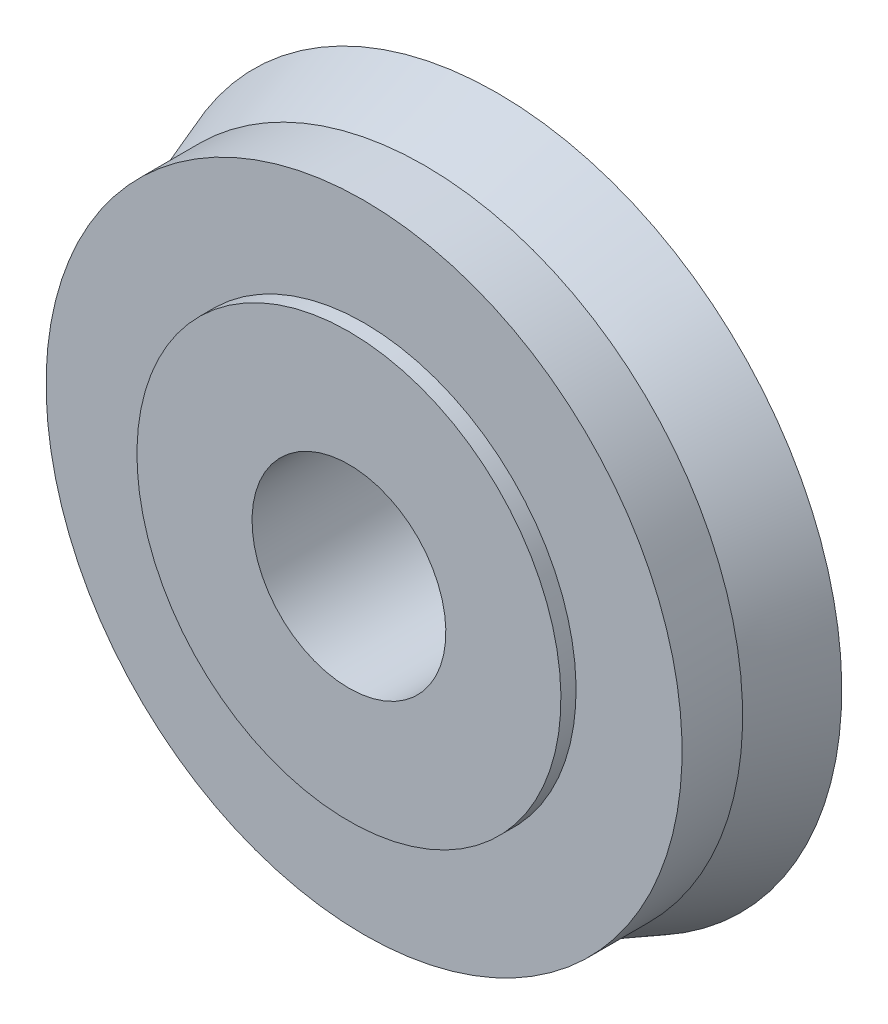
ISO-10303-21;
HEADER;
FILE_DESCRIPTION(('STEP AP214'),'2;1');
FILE_NAME('part.step','',(''),(''),'','','');
FILE_SCHEMA(('AUTOMOTIVE_DESIGN { 1 0 10303 214 1 1 1 1 }'));
ENDSEC;
DATA;
#1=APPLICATION_CONTEXT('core data for automotive mechanical design processes');
#2=APPLICATION_PROTOCOL_DEFINITION('international standard','automotive_design',2000,#1);
#3=PRODUCT_CONTEXT('',#1,'mechanical');
#4=PRODUCT('Part','Part','',(#3));
#5=PRODUCT_RELATED_PRODUCT_CATEGORY('part','',(#4));
#6=PRODUCT_DEFINITION_FORMATION('','',#4);
#7=PRODUCT_DEFINITION_CONTEXT('part definition',#1,'design');
#8=PRODUCT_DEFINITION('design','',#6,#7);
#9=PRODUCT_DEFINITION_SHAPE('','',#8);
#10=(LENGTH_UNIT() NAMED_UNIT(*) SI_UNIT(.MILLI.,.METRE.));
#11=(NAMED_UNIT(*) PLANE_ANGLE_UNIT() SI_UNIT($,.RADIAN.));
#12=(NAMED_UNIT(*) SI_UNIT($,.STERADIAN.) SOLID_ANGLE_UNIT());
#13=UNCERTAINTY_MEASURE_WITH_UNIT(LENGTH_MEASURE(1.E-05),#10,'distance_accuracy_value','');
#14=(GEOMETRIC_REPRESENTATION_CONTEXT(3) GLOBAL_UNCERTAINTY_ASSIGNED_CONTEXT((#13)) GLOBAL_UNIT_ASSIGNED_CONTEXT((#10,
#11,#12)) REPRESENTATION_CONTEXT('',''));
#15=CARTESIAN_POINT('',(0.,0.,0.));
#16=DIRECTION('',(0.,0.,1.));
#17=DIRECTION('',(1.,0.,0.));
#18=AXIS2_PLACEMENT_3D('',#15,#16,#17);
#19=CARTESIAN_POINT('',(0.,0.,2.99999999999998));
#20=DIRECTION('',(0.,0.,-1.));
#21=DIRECTION('',(0.,1.,0.));
#22=AXIS2_PLACEMENT_3D('',#19,#20,#21);
#23=CYLINDRICAL_SURFACE('',#22,35.);
#24=CARTESIAN_POINT('',(0.,0.,2.99999999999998));
#25=DIRECTION('',(0.,0.,-1.));
#26=DIRECTION('',(0.,1.,0.));
#27=AXIS2_PLACEMENT_3D('',#24,#25,#26);
#28=CIRCLE('',#27,35.);
#29=CARTESIAN_POINT('',(0.,35.,2.99999999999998));
#30=VERTEX_POINT('',#29);
#31=EDGE_CURVE('E41',#30,#30,#28,.F.);
#32=ORIENTED_EDGE('',*,*,#31,.F.);
#33=EDGE_LOOP('',(#32));
#34=FACE_BOUND('',#33,.T.);
#35=CARTESIAN_POINT('',(0.,0.,0.499999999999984));
#36=DIRECTION('',(0.,0.,-1.));
#37=DIRECTION('',(0.,1.,0.));
#38=AXIS2_PLACEMENT_3D('',#35,#36,#37);
#39=CIRCLE('',#38,35.);
#40=CARTESIAN_POINT('',(0.,35.,0.499999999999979));
#41=VERTEX_POINT('',#40);
#42=EDGE_CURVE('E18',#41,#41,#39,.T.);
#43=ORIENTED_EDGE('',*,*,#42,.F.);
#44=EDGE_LOOP('',(#43));
#45=FACE_BOUND('',#44,.T.);
#46=ADVANCED_FACE('F14',(#34,#45),#23,.T.);
#47=CARTESIAN_POINT('',(0.,0.,0.499999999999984));
#48=DIRECTION('',(0.,0.,1.));
#49=DIRECTION('',(0.,-1.,0.));
#50=AXIS2_PLACEMENT_3D('',#47,#48,#49);
#51=PLANE('',#50);
#52=ORIENTED_EDGE('',*,*,#42,.T.);
#53=EDGE_LOOP('',(#52));
#54=FACE_BOUND('',#53,.T.);
#55=CARTESIAN_POINT('',(0.,0.,0.499999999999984));
#56=DIRECTION('',(0.,0.,-1.));
#57=DIRECTION('',(0.,1.,0.));
#58=AXIS2_PLACEMENT_3D('',#55,#56,#57);
#59=CIRCLE('',#58,52.5);
#60=CARTESIAN_POINT('',(0.,52.5,0.499999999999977));
#61=VERTEX_POINT('',#60);
#62=EDGE_CURVE('E38',#61,#61,#59,.T.);
#63=ORIENTED_EDGE('',*,*,#62,.F.);
#64=EDGE_LOOP('',(#63));
#65=FACE_BOUND('',#64,.T.);
#66=ADVANCED_FACE('F51',(#54,#65),#51,.T.);
#67=CARTESIAN_POINT('',(0.,0.,2.99999999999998));
#68=DIRECTION('',(0.,0.,1.));
#69=DIRECTION('',(0.,-1.,0.));
#70=AXIS2_PLACEMENT_3D('',#67,#68,#69);
#71=PLANE('',#70);
#72=ORIENTED_EDGE('',*,*,#31,.T.);
#73=EDGE_LOOP('',(#72));
#74=FACE_BOUND('',#73,.T.);
#75=CARTESIAN_POINT('',(0.,0.,2.99999999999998));
#76=DIRECTION('',(0.,0.,1.));
#77=DIRECTION('',(0.,-1.,0.));
#78=AXIS2_PLACEMENT_3D('',#75,#76,#77);
#79=CIRCLE('',#78,16.);
#80=CARTESIAN_POINT('',(0.,-16.,2.99999999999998));
#81=VERTEX_POINT('',#80);
#82=EDGE_CURVE('E35',#81,#81,#79,.F.);
#83=ORIENTED_EDGE('',*,*,#82,.T.);
#84=EDGE_LOOP('',(#83));
#85=FACE_BOUND('',#84,.T.);
#86=ADVANCED_FACE('F60',(#74,#85),#71,.T.);
#87=CARTESIAN_POINT('',(0.,0.,0.499999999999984));
#88=DIRECTION('',(0.,0.,-1.));
#89=DIRECTION('',(0.,1.,0.));
#90=AXIS2_PLACEMENT_3D('',#87,#88,#89);
#91=CYLINDRICAL_SURFACE('',#90,52.5);
#92=CARTESIAN_POINT('',(0.,0.,-9.50000000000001));
#93=DIRECTION('',(0.,0.,-1.));
#94=DIRECTION('',(-0.707106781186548,0.707106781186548,0.));
#95=AXIS2_PLACEMENT_3D('',#92,#93,#94);
#96=CIRCLE('',#95,52.5);
#97=CARTESIAN_POINT('',(-37.1231060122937,37.1231060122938,-9.50000000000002));
#98=VERTEX_POINT('',#97);
#99=EDGE_CURVE('E31',#98,#98,#96,.T.);
#100=ORIENTED_EDGE('',*,*,#99,.F.);
#101=EDGE_LOOP('',(#100));
#102=FACE_BOUND('',#101,.T.);
#103=ORIENTED_EDGE('',*,*,#62,.T.);
#104=EDGE_LOOP('',(#103));
#105=FACE_BOUND('',#104,.T.);
#106=ADVANCED_FACE('F72',(#102,#105),#91,.T.);
#107=CARTESIAN_POINT('',(0.,0.,-21.5));
#108=DIRECTION('',(0.,0.,1.));
#109=DIRECTION('',(0.,-1.,0.));
#110=AXIS2_PLACEMENT_3D('',#107,#108,#109);
#111=CYLINDRICAL_SURFACE('',#110,16.);
#112=ORIENTED_EDGE('',*,*,#82,.F.);
#113=EDGE_LOOP('',(#112));
#114=FACE_BOUND('',#113,.T.);
#115=CARTESIAN_POINT('',(0.,0.,-21.5));
#116=DIRECTION('',(0.,0.,1.));
#117=DIRECTION('',(0.,-1.,0.));
#118=AXIS2_PLACEMENT_3D('',#115,#116,#117);
#119=CIRCLE('',#118,16.);
#120=CARTESIAN_POINT('',(0.,-16.,-21.5));
#121=VERTEX_POINT('',#120);
#122=EDGE_CURVE('E23',#121,#121,#119,.T.);
#123=ORIENTED_EDGE('',*,*,#122,.F.);
#124=EDGE_LOOP('',(#123));
#125=FACE_BOUND('',#124,.T.);
#126=ADVANCED_FACE('F66',(#114,#125),#111,.F.);
#127=CARTESIAN_POINT('',(0.,0.,-21.5));
#128=DIRECTION('',(0.,0.,-1.));
#129=DIRECTION('',(0.,1.,0.));
#130=AXIS2_PLACEMENT_3D('',#127,#128,#129);
#131=CONICAL_SURFACE('',#130,56.8676428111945,0.349065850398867);
#132=CARTESIAN_POINT('',(0.,0.,-21.5));
#133=DIRECTION('',(0.,0.,-1.));
#134=DIRECTION('',(0.,1.,0.));
#135=AXIS2_PLACEMENT_3D('',#132,#133,#134);
#136=CIRCLE('',#135,56.8676428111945);
#137=CARTESIAN_POINT('',(0.,56.8676428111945,-21.5));
#138=VERTEX_POINT('',#137);
#139=EDGE_CURVE('E10',#138,#138,#136,.T.);
#140=ORIENTED_EDGE('',*,*,#139,.F.);
#141=EDGE_LOOP('',(#140));
#142=FACE_BOUND('',#141,.T.);
#143=ORIENTED_EDGE('',*,*,#99,.T.);
#144=EDGE_LOOP('',(#143));
#145=FACE_BOUND('',#144,.T.);
#146=ADVANCED_FACE('F63',(#142,#145),#131,.T.);
#147=CARTESIAN_POINT('',(0.,0.,-21.5));
#148=DIRECTION('',(0.,0.,-1.));
#149=DIRECTION('',(0.,1.,0.));
#150=AXIS2_PLACEMENT_3D('',#147,#148,#149);
#151=PLANE('',#150);
#152=ORIENTED_EDGE('',*,*,#139,.T.);
#153=EDGE_LOOP('',(#152));
#154=FACE_BOUND('',#153,.T.);
#155=ORIENTED_EDGE('',*,*,#122,.T.);
#156=EDGE_LOOP('',(#155));
#157=FACE_BOUND('',#156,.T.);
#158=ADVANCED_FACE('F16',(#154,#157),#151,.T.);
#159=CLOSED_SHELL('',(#46,#66,#86,#106,#126,#146,#158));
#160=MANIFOLD_SOLID_BREP('B1',#159);
#161=ADVANCED_BREP_SHAPE_REPRESENTATION('',(#18,#160),#14);
#162=SHAPE_DEFINITION_REPRESENTATION(#9,#161);
ENDSEC;
END-ISO-10303-21;
